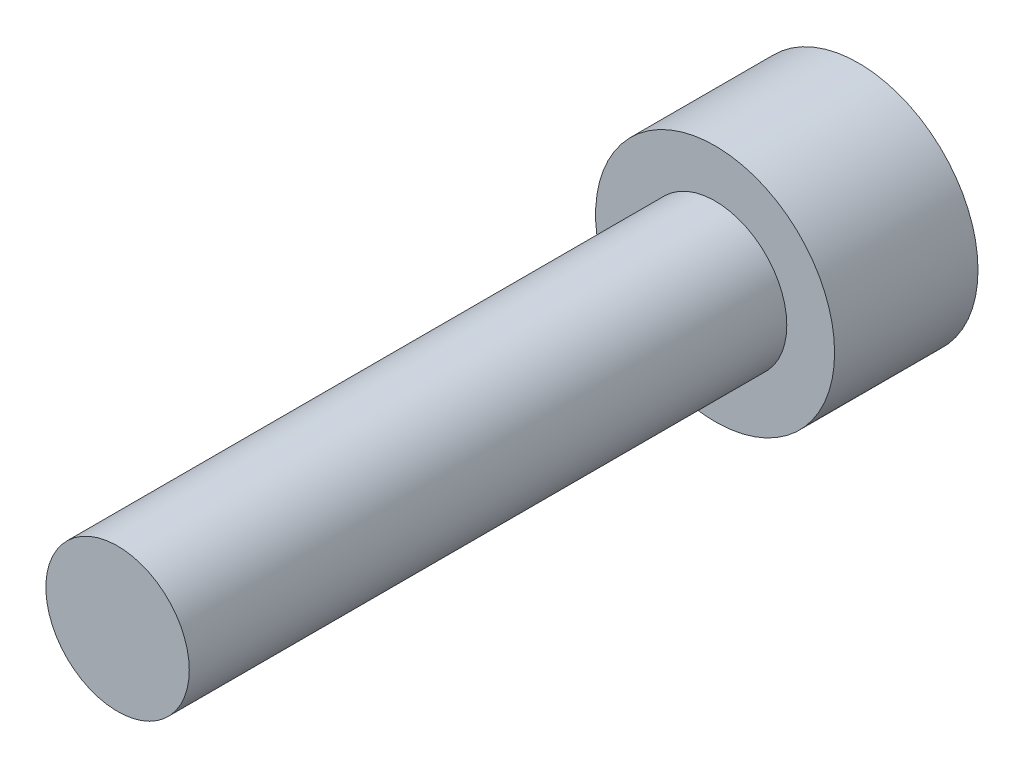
ISO-10303-21;
HEADER;
FILE_DESCRIPTION(('STEP AP214'),'2;1');
FILE_NAME('part.step','',(''),(''),'','','');
FILE_SCHEMA(('AUTOMOTIVE_DESIGN { 1 0 10303 214 1 1 1 1 }'));
ENDSEC;
DATA;
#1=APPLICATION_CONTEXT('core data for automotive mechanical design processes');
#2=APPLICATION_PROTOCOL_DEFINITION('international standard','automotive_design',2000,#1);
#3=PRODUCT_CONTEXT('',#1,'mechanical');
#4=PRODUCT('Part','Part','',(#3));
#5=PRODUCT_RELATED_PRODUCT_CATEGORY('part','',(#4));
#6=PRODUCT_DEFINITION_FORMATION('','',#4);
#7=PRODUCT_DEFINITION_CONTEXT('part definition',#1,'design');
#8=PRODUCT_DEFINITION('design','',#6,#7);
#9=PRODUCT_DEFINITION_SHAPE('','',#8);
#10=(LENGTH_UNIT() NAMED_UNIT(*) SI_UNIT(.MILLI.,.METRE.));
#11=(NAMED_UNIT(*) PLANE_ANGLE_UNIT() SI_UNIT($,.RADIAN.));
#12=(NAMED_UNIT(*) SI_UNIT($,.STERADIAN.) SOLID_ANGLE_UNIT());
#13=UNCERTAINTY_MEASURE_WITH_UNIT(LENGTH_MEASURE(1.E-05),#10,'distance_accuracy_value','');
#14=(GEOMETRIC_REPRESENTATION_CONTEXT(3) GLOBAL_UNCERTAINTY_ASSIGNED_CONTEXT((#13)) GLOBAL_UNIT_ASSIGNED_CONTEXT((#10,
#11,#12)) REPRESENTATION_CONTEXT('',''));
#15=CARTESIAN_POINT('',(0.,0.,0.));
#16=DIRECTION('',(0.,0.,1.));
#17=DIRECTION('',(1.,0.,0.));
#18=AXIS2_PLACEMENT_3D('',#15,#16,#17);
#19=CARTESIAN_POINT('',(0.,0.,25.));
#20=DIRECTION('',(0.,0.,1.));
#21=DIRECTION('',(1.,0.,0.));
#22=AXIS2_PLACEMENT_3D('',#19,#20,#21);
#23=PLANE('',#22);
#24=CARTESIAN_POINT('',(0.,0.,25.));
#25=DIRECTION('',(0.,0.,1.));
#26=DIRECTION('',(1.,0.,0.));
#27=AXIS2_PLACEMENT_3D('',#24,#25,#26);
#28=CIRCLE('',#27,3.);
#29=CARTESIAN_POINT('',(3.,0.,25.));
#30=VERTEX_POINT('',#29);
#31=EDGE_CURVE('E11',#30,#30,#28,.T.);
#32=ORIENTED_EDGE('',*,*,#31,.T.);
#33=EDGE_LOOP('',(#32));
#34=FACE_BOUND('',#33,.T.);
#35=ADVANCED_FACE('F33',(#34),#23,.T.);
#36=CARTESIAN_POINT('',(0.,0.,25.));
#37=DIRECTION('',(0.,0.,1.));
#38=DIRECTION('',(1.,0.,0.));
#39=AXIS2_PLACEMENT_3D('',#36,#37,#38);
#40=CYLINDRICAL_SURFACE('',#39,3.);
#41=CARTESIAN_POINT('',(0.,0.,0.));
#42=DIRECTION('',(0.,0.,1.));
#43=DIRECTION('',(1.,0.,0.));
#44=AXIS2_PLACEMENT_3D('',#41,#42,#43);
#45=CIRCLE('',#44,3.);
#46=CARTESIAN_POINT('',(3.,0.,0.));
#47=VERTEX_POINT('',#46);
#48=EDGE_CURVE('E40',#47,#47,#45,.T.);
#49=ORIENTED_EDGE('',*,*,#48,.T.);
#50=EDGE_LOOP('',(#49));
#51=FACE_BOUND('',#50,.T.);
#52=ORIENTED_EDGE('',*,*,#31,.F.);
#53=EDGE_LOOP('',(#52));
#54=FACE_BOUND('',#53,.T.);
#55=ADVANCED_FACE('F147',(#51,#54),#40,.T.);
#56=CARTESIAN_POINT('',(0.,-3.,0.));
#57=DIRECTION('',(0.,0.,1.));
#58=DIRECTION('',(1.,0.,0.));
#59=AXIS2_PLACEMENT_3D('',#56,#57,#58);
#60=PLANE('',#59);
#61=CARTESIAN_POINT('',(0.,0.,0.));
#62=DIRECTION('',(0.,0.,1.));
#63=DIRECTION('',(1.,0.,0.));
#64=AXIS2_PLACEMENT_3D('',#61,#62,#63);
#65=CIRCLE('',#64,5.);
#66=CARTESIAN_POINT('',(5.,0.,0.));
#67=VERTEX_POINT('',#66);
#68=EDGE_CURVE('E142',#67,#67,#65,.T.);
#69=ORIENTED_EDGE('',*,*,#68,.T.);
#70=EDGE_LOOP('',(#69));
#71=FACE_BOUND('',#70,.T.);
#72=ORIENTED_EDGE('',*,*,#48,.F.);
#73=EDGE_LOOP('',(#72));
#74=FACE_BOUND('',#73,.T.);
#75=ADVANCED_FACE('F150',(#71,#74),#60,.T.);
#76=CARTESIAN_POINT('',(0.,0.,25.));
#77=DIRECTION('',(0.,0.,1.));
#78=DIRECTION('',(1.,0.,0.));
#79=AXIS2_PLACEMENT_3D('',#76,#77,#78);
#80=CYLINDRICAL_SURFACE('',#79,5.);
#81=CARTESIAN_POINT('',(0.,0.,-6.));
#82=DIRECTION('',(0.,0.,1.));
#83=DIRECTION('',(1.,0.,0.));
#84=AXIS2_PLACEMENT_3D('',#81,#82,#83);
#85=CIRCLE('',#84,5.);
#86=CARTESIAN_POINT('',(5.,0.,-6.));
#87=VERTEX_POINT('',#86);
#88=EDGE_CURVE('E134',#87,#87,#85,.T.);
#89=ORIENTED_EDGE('',*,*,#88,.T.);
#90=EDGE_LOOP('',(#89));
#91=FACE_BOUND('',#90,.T.);
#92=ORIENTED_EDGE('',*,*,#68,.F.);
#93=EDGE_LOOP('',(#92));
#94=FACE_BOUND('',#93,.T.);
#95=ADVANCED_FACE('F152',(#91,#94),#80,.T.);
#96=CARTESIAN_POINT('',(0.,-5.,-6.));
#97=DIRECTION('',(0.,0.,-1.));
#98=DIRECTION('',(-1.,0.,0.));
#99=AXIS2_PLACEMENT_3D('',#96,#97,#98);
#100=PLANE('',#99);
#101=DIRECTION('',(0.866025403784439,-0.5,0.));
#102=VECTOR('',#101,1.);
#103=CARTESIAN_POINT('',(0.,2.88675134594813,-6.));
#104=LINE('',#103,#102);
#105=CARTESIAN_POINT('',(0.,2.88675134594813,-6.));
#106=VERTEX_POINT('',#105);
#107=CARTESIAN_POINT('',(2.5,1.44337567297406,-6.));
#108=VERTEX_POINT('',#107);
#109=EDGE_CURVE('E47',#106,#108,#104,.T.);
#110=ORIENTED_EDGE('',*,*,#109,.F.);
#111=DIRECTION('',(0.866025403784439,0.5,0.));
#112=VECTOR('',#111,1.);
#113=CARTESIAN_POINT('',(-2.5,1.44337567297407,-6.));
#114=LINE('',#113,#112);
#115=CARTESIAN_POINT('',(-2.5,1.44337567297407,-6.));
#116=VERTEX_POINT('',#115);
#117=EDGE_CURVE('E130',#116,#106,#114,.T.);
#118=ORIENTED_EDGE('',*,*,#117,.F.);
#119=DIRECTION('',(0.,1.,0.));
#120=VECTOR('',#119,1.);
#121=CARTESIAN_POINT('',(-2.5,-1.44337567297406,-6.));
#122=LINE('',#121,#120);
#123=CARTESIAN_POINT('',(-2.5,-1.44337567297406,-6.));
#124=VERTEX_POINT('',#123);
#125=EDGE_CURVE('E128',#124,#116,#122,.T.);
#126=ORIENTED_EDGE('',*,*,#125,.F.);
#127=DIRECTION('',(-0.866025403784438,0.5,0.));
#128=VECTOR('',#127,1.);
#129=CARTESIAN_POINT('',(0.,-2.88675134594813,-6.));
#130=LINE('',#129,#128);
#131=CARTESIAN_POINT('',(0.,-2.88675134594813,-6.));
#132=VERTEX_POINT('',#131);
#133=EDGE_CURVE('E95',#132,#124,#130,.T.);
#134=ORIENTED_EDGE('',*,*,#133,.F.);
#135=DIRECTION('',(-0.866025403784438,-0.5,0.));
#136=VECTOR('',#135,1.);
#137=CARTESIAN_POINT('',(2.5,-1.44337567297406,-6.));
#138=LINE('',#137,#136);
#139=CARTESIAN_POINT('',(2.5,-1.44337567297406,-6.));
#140=VERTEX_POINT('',#139);
#141=EDGE_CURVE('E124',#140,#132,#138,.T.);
#142=ORIENTED_EDGE('',*,*,#141,.F.);
#143=DIRECTION('',(0.,-1.,0.));
#144=VECTOR('',#143,1.);
#145=CARTESIAN_POINT('',(2.5,1.44337567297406,-6.));
#146=LINE('',#145,#144);
#147=EDGE_CURVE('E121',#108,#140,#146,.T.);
#148=ORIENTED_EDGE('',*,*,#147,.F.);
#149=EDGE_LOOP('',(#110,#118,#126,#134,#142,#148));
#150=FACE_BOUND('',#149,.T.);
#151=ORIENTED_EDGE('',*,*,#88,.F.);
#152=EDGE_LOOP('',(#151));
#153=FACE_BOUND('',#152,.T.);
#154=ADVANCED_FACE('F159',(#150,#153),#100,.T.);
#155=CARTESIAN_POINT('',(0.,2.88675134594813,-1.));
#156=DIRECTION('',(0.5,0.866025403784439,0.));
#157=DIRECTION('',(-0.866025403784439,0.5,0.));
#158=AXIS2_PLACEMENT_3D('',#155,#156,#157);
#159=PLANE('',#158);
#160=ORIENTED_EDGE('',*,*,#109,.T.);
#161=DIRECTION('',(0.,0.,-1.));
#162=VECTOR('',#161,1.);
#163=CARTESIAN_POINT('',(2.5,1.44337567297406,-1.));
#164=LINE('',#163,#162);
#165=CARTESIAN_POINT('',(2.5,1.44337567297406,-1.));
#166=VERTEX_POINT('',#165);
#167=EDGE_CURVE('E77',#166,#108,#164,.T.);
#168=ORIENTED_EDGE('',*,*,#167,.F.);
#169=DIRECTION('',(0.866025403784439,-0.5,0.));
#170=VECTOR('',#169,1.);
#171=CARTESIAN_POINT('',(0.,2.88675134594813,-1.));
#172=LINE('',#171,#170);
#173=CARTESIAN_POINT('',(0.,2.88675134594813,-1.));
#174=VERTEX_POINT('',#173);
#175=EDGE_CURVE('E132',#174,#166,#172,.T.);
#176=ORIENTED_EDGE('',*,*,#175,.F.);
#177=DIRECTION('',(0.,0.,-1.));
#178=VECTOR('',#177,1.);
#179=CARTESIAN_POINT('',(0.,2.88675134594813,-1.));
#180=LINE('',#179,#178);
#181=EDGE_CURVE('E55',#174,#106,#180,.T.);
#182=ORIENTED_EDGE('',*,*,#181,.T.);
#183=EDGE_LOOP('',(#160,#168,#176,#182));
#184=FACE_BOUND('',#183,.T.);
#185=ADVANCED_FACE('F190',(#184),#159,.F.);
#186=CARTESIAN_POINT('',(-2.5,1.44337567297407,-1.));
#187=DIRECTION('',(-0.5,0.866025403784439,0.));
#188=DIRECTION('',(-0.866025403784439,-0.5,0.));
#189=AXIS2_PLACEMENT_3D('',#186,#187,#188);
#190=PLANE('',#189);
#191=ORIENTED_EDGE('',*,*,#117,.T.);
#192=ORIENTED_EDGE('',*,*,#181,.F.);
#193=DIRECTION('',(0.866025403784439,0.5,0.));
#194=VECTOR('',#193,1.);
#195=CARTESIAN_POINT('',(-2.5,1.44337567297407,-1.));
#196=LINE('',#195,#194);
#197=CARTESIAN_POINT('',(-2.5,1.44337567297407,-1.));
#198=VERTEX_POINT('',#197);
#199=EDGE_CURVE('E107',#198,#174,#196,.T.);
#200=ORIENTED_EDGE('',*,*,#199,.F.);
#201=DIRECTION('',(0.,0.,-1.));
#202=VECTOR('',#201,1.);
#203=CARTESIAN_POINT('',(-2.5,1.44337567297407,-1.));
#204=LINE('',#203,#202);
#205=EDGE_CURVE('E99',#198,#116,#204,.T.);
#206=ORIENTED_EDGE('',*,*,#205,.T.);
#207=EDGE_LOOP('',(#191,#192,#200,#206));
#208=FACE_BOUND('',#207,.T.);
#209=ADVANCED_FACE('F200',(#208),#190,.F.);
#210=CARTESIAN_POINT('',(-2.5,-1.44337567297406,-1.));
#211=DIRECTION('',(-1.,0.,0.));
#212=DIRECTION('',(0.,-1.,0.));
#213=AXIS2_PLACEMENT_3D('',#210,#211,#212);
#214=PLANE('',#213);
#215=ORIENTED_EDGE('',*,*,#125,.T.);
#216=ORIENTED_EDGE('',*,*,#205,.F.);
#217=DIRECTION('',(0.,1.,0.));
#218=VECTOR('',#217,1.);
#219=CARTESIAN_POINT('',(-2.5,-1.44337567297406,-1.));
#220=LINE('',#219,#218);
#221=CARTESIAN_POINT('',(-2.5,-1.44337567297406,-1.));
#222=VERTEX_POINT('',#221);
#223=EDGE_CURVE('E103',#222,#198,#220,.T.);
#224=ORIENTED_EDGE('',*,*,#223,.F.);
#225=DIRECTION('',(0.,0.,-1.));
#226=VECTOR('',#225,1.);
#227=CARTESIAN_POINT('',(-2.5,-1.44337567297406,-1.));
#228=LINE('',#227,#226);
#229=EDGE_CURVE('E88',#222,#124,#228,.T.);
#230=ORIENTED_EDGE('',*,*,#229,.T.);
#231=EDGE_LOOP('',(#215,#216,#224,#230));
#232=FACE_BOUND('',#231,.T.);
#233=ADVANCED_FACE('F104',(#232),#214,.F.);
#234=CARTESIAN_POINT('',(0.,-2.88675134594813,-1.));
#235=DIRECTION('',(-0.5,-0.866025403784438,0.));
#236=DIRECTION('',(0.866025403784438,-0.5,0.));
#237=AXIS2_PLACEMENT_3D('',#234,#235,#236);
#238=PLANE('',#237);
#239=ORIENTED_EDGE('',*,*,#133,.T.);
#240=ORIENTED_EDGE('',*,*,#229,.F.);
#241=DIRECTION('',(-0.866025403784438,0.5,0.));
#242=VECTOR('',#241,1.);
#243=CARTESIAN_POINT('',(0.,-2.88675134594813,-1.));
#244=LINE('',#243,#242);
#245=CARTESIAN_POINT('',(0.,-2.88675134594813,-1.));
#246=VERTEX_POINT('',#245);
#247=EDGE_CURVE('E92',#246,#222,#244,.T.);
#248=ORIENTED_EDGE('',*,*,#247,.F.);
#249=DIRECTION('',(0.,0.,-1.));
#250=VECTOR('',#249,1.);
#251=CARTESIAN_POINT('',(0.,-2.88675134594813,-1.));
#252=LINE('',#251,#250);
#253=EDGE_CURVE('E100',#246,#132,#252,.T.);
#254=ORIENTED_EDGE('',*,*,#253,.T.);
#255=EDGE_LOOP('',(#239,#240,#248,#254));
#256=FACE_BOUND('',#255,.T.);
#257=ADVANCED_FACE('F90',(#256),#238,.F.);
#258=CARTESIAN_POINT('',(2.5,-1.44337567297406,-1.));
#259=DIRECTION('',(0.5,-0.866025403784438,0.));
#260=DIRECTION('',(0.866025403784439,0.5,0.));
#261=AXIS2_PLACEMENT_3D('',#258,#259,#260);
#262=PLANE('',#261);
#263=ORIENTED_EDGE('',*,*,#141,.T.);
#264=ORIENTED_EDGE('',*,*,#253,.F.);
#265=DIRECTION('',(-0.866025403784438,-0.5,0.));
#266=VECTOR('',#265,1.);
#267=CARTESIAN_POINT('',(2.5,-1.44337567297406,-1.));
#268=LINE('',#267,#266);
#269=CARTESIAN_POINT('',(2.5,-1.44337567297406,-1.));
#270=VERTEX_POINT('',#269);
#271=EDGE_CURVE('E113',#270,#246,#268,.T.);
#272=ORIENTED_EDGE('',*,*,#271,.F.);
#273=DIRECTION('',(0.,0.,-1.));
#274=VECTOR('',#273,1.);
#275=CARTESIAN_POINT('',(2.5,-1.44337567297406,-1.));
#276=LINE('',#275,#274);
#277=EDGE_CURVE('E137',#270,#140,#276,.T.);
#278=ORIENTED_EDGE('',*,*,#277,.T.);
#279=EDGE_LOOP('',(#263,#264,#272,#278));
#280=FACE_BOUND('',#279,.T.);
#281=ADVANCED_FACE('F225',(#280),#262,.F.);
#282=CARTESIAN_POINT('',(2.5,1.44337567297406,-1.));
#283=DIRECTION('',(1.,0.,0.));
#284=DIRECTION('',(0.,0.,-1.));
#285=AXIS2_PLACEMENT_3D('',#282,#283,#284);
#286=PLANE('',#285);
#287=ORIENTED_EDGE('',*,*,#147,.T.);
#288=ORIENTED_EDGE('',*,*,#277,.F.);
#289=DIRECTION('',(0.,-1.,0.));
#290=VECTOR('',#289,1.);
#291=CARTESIAN_POINT('',(2.5,1.44337567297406,-1.));
#292=LINE('',#291,#290);
#293=EDGE_CURVE('E115',#166,#270,#292,.T.);
#294=ORIENTED_EDGE('',*,*,#293,.F.);
#295=ORIENTED_EDGE('',*,*,#167,.T.);
#296=EDGE_LOOP('',(#287,#288,#294,#295));
#297=FACE_BOUND('',#296,.T.);
#298=ADVANCED_FACE('F234',(#297),#286,.F.);
#299=CARTESIAN_POINT('',(5.,0.,-1.));
#300=DIRECTION('',(0.,0.,-1.));
#301=DIRECTION('',(-1.,0.,0.));
#302=AXIS2_PLACEMENT_3D('',#299,#300,#301);
#303=PLANE('',#302);
#304=ORIENTED_EDGE('',*,*,#175,.T.);
#305=ORIENTED_EDGE('',*,*,#293,.T.);
#306=ORIENTED_EDGE('',*,*,#271,.T.);
#307=ORIENTED_EDGE('',*,*,#247,.T.);
#308=ORIENTED_EDGE('',*,*,#223,.T.);
#309=ORIENTED_EDGE('',*,*,#199,.T.);
#310=EDGE_LOOP('',(#304,#305,#306,#307,#308,#309));
#311=FACE_BOUND('',#310,.T.);
#312=ADVANCED_FACE('F110',(#311),#303,.T.);
#313=CLOSED_SHELL('',(#35,#55,#75,#95,#154,#185,#209,#233,#257,#281,#298,#312));
#314=MANIFOLD_SOLID_BREP('B2',#313);
#315=ADVANCED_BREP_SHAPE_REPRESENTATION('',(#18,#314),#14);
#316=SHAPE_DEFINITION_REPRESENTATION(#9,#315);
ENDSEC;
END-ISO-10303-21;
